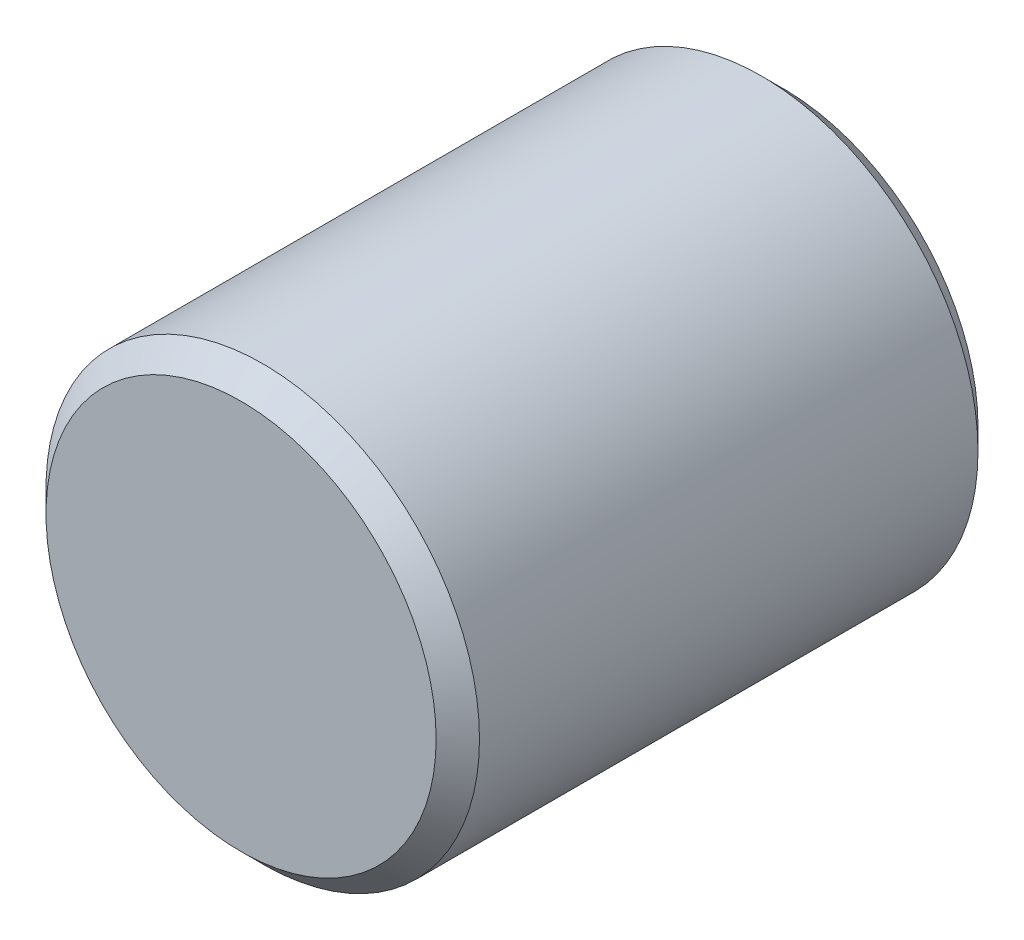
ISO-10303-21;
HEADER;
FILE_DESCRIPTION(('STEP AP214'),'2;1');
FILE_NAME('part.step','',(''),(''),'','','');
FILE_SCHEMA(('AUTOMOTIVE_DESIGN { 1 0 10303 214 1 1 1 1 }'));
ENDSEC;
DATA;
#1=APPLICATION_CONTEXT('core data for automotive mechanical design processes');
#2=APPLICATION_PROTOCOL_DEFINITION('international standard','automotive_design',2000,#1);
#3=PRODUCT_CONTEXT('',#1,'mechanical');
#4=PRODUCT('Part','Part','',(#3));
#5=PRODUCT_RELATED_PRODUCT_CATEGORY('part','',(#4));
#6=PRODUCT_DEFINITION_FORMATION('','',#4);
#7=PRODUCT_DEFINITION_CONTEXT('part definition',#1,'design');
#8=PRODUCT_DEFINITION('design','',#6,#7);
#9=PRODUCT_DEFINITION_SHAPE('','',#8);
#10=(LENGTH_UNIT() NAMED_UNIT(*) SI_UNIT(.MILLI.,.METRE.));
#11=(NAMED_UNIT(*) PLANE_ANGLE_UNIT() SI_UNIT($,.RADIAN.));
#12=(NAMED_UNIT(*) SI_UNIT($,.STERADIAN.) SOLID_ANGLE_UNIT());
#13=UNCERTAINTY_MEASURE_WITH_UNIT(LENGTH_MEASURE(1.E-05),#10,'distance_accuracy_value','');
#14=(GEOMETRIC_REPRESENTATION_CONTEXT(3) GLOBAL_UNCERTAINTY_ASSIGNED_CONTEXT((#13)) GLOBAL_UNIT_ASSIGNED_CONTEXT((#10,
#11,#12)) REPRESENTATION_CONTEXT('',''));
#15=CARTESIAN_POINT('',(0.,0.,0.));
#16=DIRECTION('',(0.,0.,1.));
#17=DIRECTION('',(1.,0.,0.));
#18=AXIS2_PLACEMENT_3D('',#15,#16,#17);
#19=CARTESIAN_POINT('',(0.,0.,30.));
#20=DIRECTION('',(0.,0.,-1.));
#21=DIRECTION('',(-1.,0.,0.));
#22=AXIS2_PLACEMENT_3D('',#19,#20,#21);
#23=CYLINDRICAL_SURFACE('',#22,12.);
#24=CARTESIAN_POINT('',(0.,0.,28.8));
#25=DIRECTION('',(0.,0.,1.));
#26=DIRECTION('',(1.,0.,0.));
#27=AXIS2_PLACEMENT_3D('',#24,#25,#26);
#28=CIRCLE('',#27,12.);
#29=CARTESIAN_POINT('',(12.,0.,28.8));
#30=VERTEX_POINT('',#29);
#31=EDGE_CURVE('E8',#30,#30,#28,.F.);
#32=ORIENTED_EDGE('',*,*,#31,.T.);
#33=EDGE_LOOP('',(#32));
#34=FACE_BOUND('',#33,.T.);
#35=CARTESIAN_POINT('',(0.,0.,1.2));
#36=DIRECTION('',(0.,0.,1.));
#37=DIRECTION('',(1.,0.,0.));
#38=AXIS2_PLACEMENT_3D('',#35,#36,#37);
#39=CIRCLE('',#38,12.);
#40=CARTESIAN_POINT('',(12.,0.,1.2));
#41=VERTEX_POINT('',#40);
#42=EDGE_CURVE('E26',#41,#41,#39,.T.);
#43=ORIENTED_EDGE('',*,*,#42,.T.);
#44=EDGE_LOOP('',(#43));
#45=FACE_BOUND('',#44,.T.);
#46=ADVANCED_FACE('F12',(#34,#45),#23,.T.);
#47=CARTESIAN_POINT('',(0.,0.,30.));
#48=DIRECTION('',(0.,0.,1.));
#49=DIRECTION('',(1.,0.,0.));
#50=AXIS2_PLACEMENT_3D('',#47,#48,#49);
#51=PLANE('',#50);
#52=CARTESIAN_POINT('',(0.,0.,30.));
#53=DIRECTION('',(0.,0.,1.));
#54=DIRECTION('',(1.,0.,0.));
#55=AXIS2_PLACEMENT_3D('',#52,#53,#54);
#56=CIRCLE('',#55,10.8);
#57=CARTESIAN_POINT('',(10.8,0.,30.));
#58=VERTEX_POINT('',#57);
#59=EDGE_CURVE('E18',#58,#58,#56,.T.);
#60=ORIENTED_EDGE('',*,*,#59,.T.);
#61=EDGE_LOOP('',(#60));
#62=FACE_BOUND('',#61,.T.);
#63=ADVANCED_FACE('F60',(#62),#51,.T.);
#64=CARTESIAN_POINT('',(0.,0.,0.));
#65=DIRECTION('',(0.,0.,1.));
#66=DIRECTION('',(1.,0.,0.));
#67=AXIS2_PLACEMENT_3D('',#64,#65,#66);
#68=PLANE('',#67);
#69=CARTESIAN_POINT('',(0.,0.,0.));
#70=DIRECTION('',(0.,0.,-1.));
#71=DIRECTION('',(-1.,0.,0.));
#72=AXIS2_PLACEMENT_3D('',#69,#70,#71);
#73=CIRCLE('',#72,4.6);
#74=CARTESIAN_POINT('',(-4.6,0.,0.));
#75=VERTEX_POINT('',#74);
#76=EDGE_CURVE('E31',#75,#75,#73,.T.);
#77=ORIENTED_EDGE('',*,*,#76,.F.);
#78=EDGE_LOOP('',(#77));
#79=FACE_BOUND('',#78,.T.);
#80=CARTESIAN_POINT('',(0.,0.,0.));
#81=DIRECTION('',(0.,0.,1.));
#82=DIRECTION('',(1.,0.,0.));
#83=AXIS2_PLACEMENT_3D('',#80,#81,#82);
#84=CIRCLE('',#83,10.8);
#85=CARTESIAN_POINT('',(10.8,0.,0.));
#86=VERTEX_POINT('',#85);
#87=EDGE_CURVE('E22',#86,#86,#84,.F.);
#88=ORIENTED_EDGE('',*,*,#87,.T.);
#89=EDGE_LOOP('',(#88));
#90=FACE_BOUND('',#89,.T.);
#91=ADVANCED_FACE('F56',(#79,#90),#68,.F.);
#92=CARTESIAN_POINT('',(0.,0.,1.2));
#93=DIRECTION('',(0.,0.,1.));
#94=DIRECTION('',(1.,0.,0.));
#95=AXIS2_PLACEMENT_3D('',#92,#93,#94);
#96=CONICAL_SURFACE('',#95,12.,0.78539816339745);
#97=ORIENTED_EDGE('',*,*,#87,.F.);
#98=EDGE_LOOP('',(#97));
#99=FACE_BOUND('',#98,.T.);
#100=ORIENTED_EDGE('',*,*,#42,.F.);
#101=EDGE_LOOP('',(#100));
#102=FACE_BOUND('',#101,.T.);
#103=ADVANCED_FACE('F59',(#99,#102),#96,.T.);
#104=CARTESIAN_POINT('',(0.,0.,30.));
#105=DIRECTION('',(0.,0.,-1.));
#106=DIRECTION('',(-1.,0.,0.));
#107=AXIS2_PLACEMENT_3D('',#104,#105,#106);
#108=CONICAL_SURFACE('',#107,10.8,0.785398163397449);
#109=ORIENTED_EDGE('',*,*,#31,.F.);
#110=EDGE_LOOP('',(#109));
#111=FACE_BOUND('',#110,.T.);
#112=ORIENTED_EDGE('',*,*,#59,.F.);
#113=EDGE_LOOP('',(#112));
#114=FACE_BOUND('',#113,.T.);
#115=ADVANCED_FACE('F52',(#111,#114),#108,.T.);
#116=CARTESIAN_POINT('',(0.,0.,0.));
#117=DIRECTION('',(0.,0.,-1.));
#118=DIRECTION('',(-1.,0.,0.));
#119=AXIS2_PLACEMENT_3D('',#116,#117,#118);
#120=CONICAL_SURFACE('',#119,4.6,0.785398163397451);
#121=CARTESIAN_POINT('',(0.,0.,0.6));
#122=DIRECTION('',(0.,0.,-1.));
#123=DIRECTION('',(-1.,0.,0.));
#124=AXIS2_PLACEMENT_3D('',#121,#122,#123);
#125=CIRCLE('',#124,4.);
#126=CARTESIAN_POINT('',(-4.,0.,0.6));
#127=VERTEX_POINT('',#126);
#128=EDGE_CURVE('E34',#127,#127,#125,.T.);
#129=ORIENTED_EDGE('',*,*,#128,.F.);
#130=EDGE_LOOP('',(#129));
#131=FACE_BOUND('',#130,.T.);
#132=ORIENTED_EDGE('',*,*,#76,.T.);
#133=EDGE_LOOP('',(#132));
#134=FACE_BOUND('',#133,.T.);
#135=ADVANCED_FACE('F46',(#131,#134),#120,.F.);
#136=CARTESIAN_POINT('',(0.,0.,0.));
#137=DIRECTION('',(0.,0.,-1.));
#138=DIRECTION('',(-1.,0.,0.));
#139=AXIS2_PLACEMENT_3D('',#136,#137,#138);
#140=CYLINDRICAL_SURFACE('',#139,4.);
#141=CARTESIAN_POINT('',(0.,0.,16.));
#142=DIRECTION('',(0.,0.,-1.));
#143=DIRECTION('',(-1.,0.,0.));
#144=AXIS2_PLACEMENT_3D('',#141,#142,#143);
#145=CIRCLE('',#144,4.);
#146=CARTESIAN_POINT('',(-4.,0.,16.));
#147=VERTEX_POINT('',#146);
#148=EDGE_CURVE('E37',#147,#147,#145,.T.);
#149=ORIENTED_EDGE('',*,*,#148,.F.);
#150=EDGE_LOOP('',(#149));
#151=FACE_BOUND('',#150,.T.);
#152=ORIENTED_EDGE('',*,*,#128,.T.);
#153=EDGE_LOOP('',(#152));
#154=FACE_BOUND('',#153,.T.);
#155=ADVANCED_FACE('F43',(#151,#154),#140,.F.);
#156=CARTESIAN_POINT('',(3.4,0.,16.));
#157=DIRECTION('',(0.,0.,1.));
#158=DIRECTION('',(1.,0.,0.));
#159=AXIS2_PLACEMENT_3D('',#156,#157,#158);
#160=PLANE('',#159);
#161=ORIENTED_EDGE('',*,*,#148,.T.);
#162=EDGE_LOOP('',(#161));
#163=FACE_BOUND('',#162,.T.);
#164=ADVANCED_FACE('F41',(#163),#160,.F.);
#165=CLOSED_SHELL('',(#46,#63,#91,#103,#115,#135,#155,#164));
#166=MANIFOLD_SOLID_BREP('B1',#165);
#167=ADVANCED_BREP_SHAPE_REPRESENTATION('',(#18,#166),#14);
#168=SHAPE_DEFINITION_REPRESENTATION(#9,#167);
ENDSEC;
END-ISO-10303-21;
